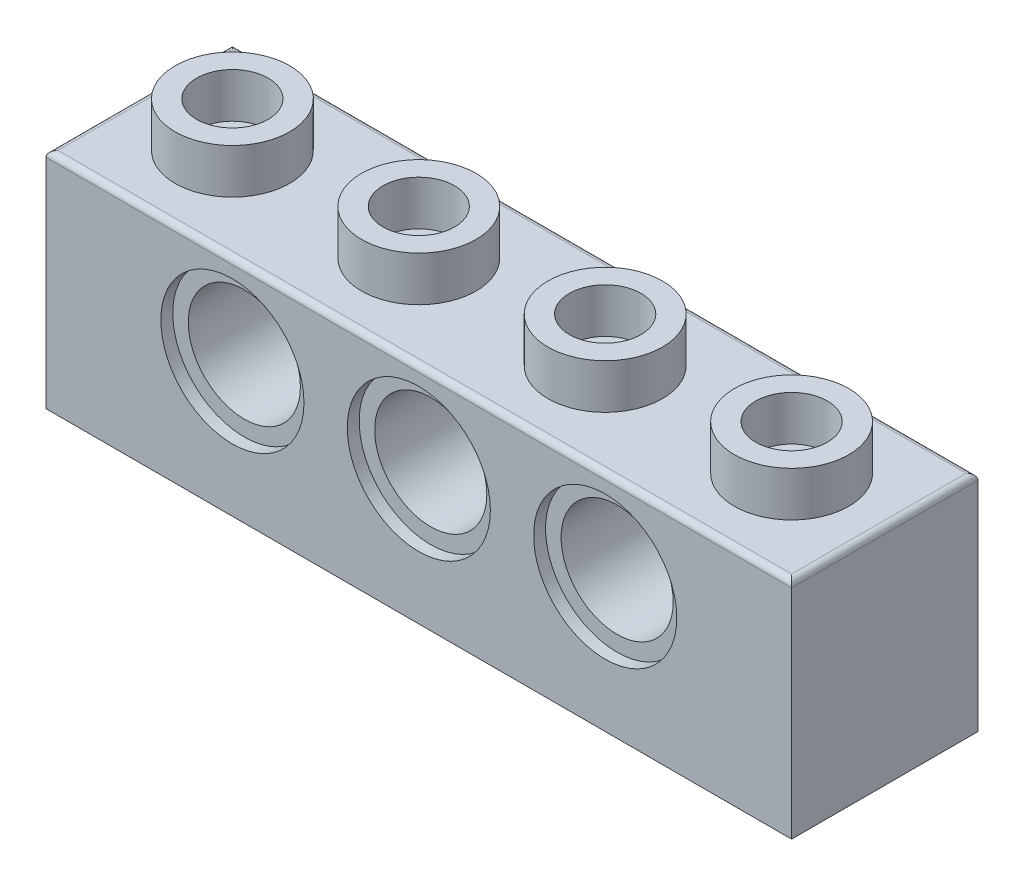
from build123d import *

# Parameters (mm, degrees)
SKETCH1_W                = 31.75
SKETCH1_H                = 7.9375
BASE_EXTRUDE_DEPTH       = 9.525
SKETCH2_R                = 2.4384
BOSS_EXTRUDE1_DEPTH      = 1.905
LPATTERN4_COUNT          = 4
LPATTERN4_PITCH          = 7.9375
SHELL1_T                 = -1.5875
SKETCH5_R                = 2.3876
CUT_EXTRUDE1_DEPTH       = 22.110765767
SKETCH6_R                = 3.048
CBORE1_DEPTH             = 0.508
CBORE2_START             = -0.762
SKETCH7_R                = 3.048
CBORE2_DEPTH             = 0.762
BOSS_EXTRUDE_THIN1_START = -5.842
SKETCH8_R                = 3.3876
SKETCH8_R_2              = 2.3876
BOSS_EXTRUDE_THIN1_DEPTH = 4.7625
LPATTERN7_COUNT          = 3
LPATTERN7_PITCH          = 7.9375
INSDOT2_REACH            = 21.96
INSDOT2_END_RADIUS       = 3.3876
SKETCH4_R                = 1.27
LPATTERN6_COUNT          = 3
LPATTERN6_PITCH          = 7.9375
CUT_EXTRUDE2_START       = -1.905
SKETCH10_R               = 1.524
CUT_EXTRUDE2_DEPTH       = 1.905
LPATTERN8_COUNT          = 4
LPATTERN8_PITCH          = 7.9375
FILLET1_R                = 0.254


with BuildPart() as part:
    # Sketch1 → Base-Extrude (new body)
    with BuildSketch(Plane(origin=(0, 0, 0), x_dir=(1, 0, 0), z_dir=(0, 1, 0))):
        Rectangle(SKETCH1_W, SKETCH1_H)
    extrude(amount=BASE_EXTRUDE_DEPTH)

    # Sketch2 → Boss-Extrude1 (add)
    with BuildSketch(Plane(origin=(0, 9.525, 0), x_dir=(-1, 0, 0), z_dir=(0, 1, 0))):
        with Locations(Location((11.90625, 0, 0), (0, 0, 270))):
            Circle(SKETCH2_R)
    boss_extrude1 = extrude(amount=BOSS_EXTRUDE1_DEPTH)

    # LPattern4: Boss-Extrude1 ×4
    with Locations(*[(i * LPATTERN4_PITCH, 0, 0) for i in range(1, LPATTERN4_COUNT)]):
        add(boss_extrude1)

    # Shell1
    shell1_openings = [part.faces().sort_by_distance(p)[0] for p in [
        (0, 0, 0),
    ]]
    offset(amount=SHELL1_T, openings=shell1_openings, kind=Kind.INTERSECTION)

    # Sketch5 → Cut-Extrude1 (cut, through all)
    with BuildSketch(Plane.XY.offset(3.96875)):
        with Locations((-7.9375, 5.715)):
            Circle(SKETCH5_R)
    cut_extrude1 = extrude(amount=-CUT_EXTRUDE1_DEPTH, mode=Mode.SUBTRACT)

    # Sketch6 → cbore1 (cut)
    with BuildSketch(Plane.XY.offset(3.96875)):
        with Locations((-7.9375, 5.715)):
            Circle(SKETCH6_R)
    cbore1 = extrude(amount=-CBORE1_DEPTH, mode=Mode.SUBTRACT)

    # Sketch7 → cbore2 (cut)
    with BuildSketch(Plane(origin=(0, 0, -3.96875), x_dir=(-1, 0, 0), z_dir=(0, 0, -1)).offset(CBORE2_START)):
        with Locations(Location((7.9375, 5.715, 0), (0, 0, 180))):
            Circle(SKETCH7_R)
    cbore2 = extrude(amount=CBORE2_DEPTH, mode=Mode.SUBTRACT)

    # Sketch8 → Boss-Extrude-Thin1 (add)
    with BuildSketch(Plane.XY.offset(3.46075).offset(BOSS_EXTRUDE_THIN1_START)):
        with Locations((-7.9375, 5.715)):
            Circle(SKETCH8_R)
        with Locations((-7.9375, 5.715)):
            Circle(SKETCH8_R_2, mode=Mode.SUBTRACT)
    boss_extrude_thin1 = extrude(amount=BOSS_EXTRUDE_THIN1_DEPTH)

    # LPattern7: Cut-Extrude1, cbore1, cbore2, Boss-Extrude-Thin1 ×3
    with Locations(*[(i * LPATTERN7_PITCH, 0, 0) for i in range(1, LPATTERN7_COUNT)]):
        add(cut_extrude1, mode=Mode.SUBTRACT)
        add(cbore1, mode=Mode.SUBTRACT)
        add(cbore2, mode=Mode.SUBTRACT)
        add(boss_extrude_thin1)

    # InsDot2: up to this cylinder (the profile starts outside it)
    insdot2_end = Plane(origin=(7.9375, 5.715, 0), z_dir=(0, 0, 1)) * Cylinder(INSDOT2_END_RADIUS, 51.6952, mode=Mode.PRIVATE)
    # Sketch4 → InsDot2 (add, up to the surface)
    with BuildSketch(Plane.XZ, mode=Mode.PRIVATE) as insdot2_sk1:
        with Locations(Location((7.9375, 0, 0), (0, 0, 270))):
            Circle(SKETCH4_R)
    insdot2_tool1 = extrude(insdot2_sk1.sketch, amount=-INSDOT2_REACH, mode=Mode.PRIVATE) - insdot2_end
    insdot2 = insdot2_tool1.solids().sort_by_distance((7.9375, 0, 0))[0]
    add(insdot2)

    # LPattern6: InsDot2 ×3
    with Locations(*[(-i * LPATTERN6_PITCH, 0, 0) for i in range(1, LPATTERN6_COUNT)]):
        add(insdot2)

    # Sketch10 → Cut-Extrude2 (cut)
    with BuildSketch(Plane(origin=(0, 11.43, 0), x_dir=(-1, 0, 0), z_dir=(0, 1, 0)).offset(CUT_EXTRUDE2_START)):
        with Locations(Location((11.90625, 0, 0), (0, 0, 90))):
            Circle(SKETCH10_R)
    cut_extrude2 = extrude(amount=CUT_EXTRUDE2_DEPTH, mode=Mode.SUBTRACT)

    # LPattern8: Cut-Extrude2 ×4
    with Locations(*[(i * LPATTERN8_PITCH, 0, 0) for i in range(1, LPATTERN8_COUNT)]):
        add(cut_extrude2, mode=Mode.SUBTRACT)

    # Fillet1
    fillet1_edges = [part.edges().sort_by_distance(p)[0] for p in [
        (15.875, 9.525, 0),
        (0, 9.525, -3.96875),
        (-15.875, 9.525, 0),
        (0, 9.525, 3.96875),
    ]]
    fillet(fillet1_edges, radius=FILLET1_R)


solid = part.part
